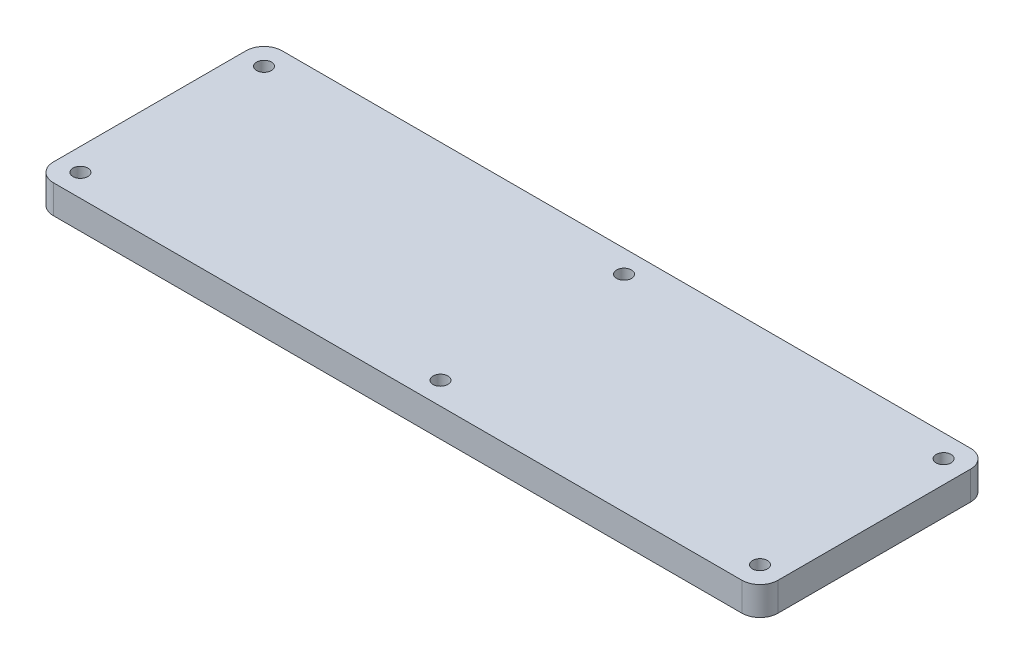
ISO-10303-21;
HEADER;
FILE_DESCRIPTION(('STEP AP214'),'2;1');
FILE_NAME('part.step','',(''),(''),'','','');
FILE_SCHEMA(('AUTOMOTIVE_DESIGN { 1 0 10303 214 1 1 1 1 }'));
ENDSEC;
DATA;
#1=APPLICATION_CONTEXT('core data for automotive mechanical design processes');
#2=APPLICATION_PROTOCOL_DEFINITION('international standard','automotive_design',2000,#1);
#3=PRODUCT_CONTEXT('',#1,'mechanical');
#4=PRODUCT('Part','Part','',(#3));
#5=PRODUCT_RELATED_PRODUCT_CATEGORY('part','',(#4));
#6=PRODUCT_DEFINITION_FORMATION('','',#4);
#7=PRODUCT_DEFINITION_CONTEXT('part definition',#1,'design');
#8=PRODUCT_DEFINITION('design','',#6,#7);
#9=PRODUCT_DEFINITION_SHAPE('','',#8);
#10=(LENGTH_UNIT() NAMED_UNIT(*) SI_UNIT(.MILLI.,.METRE.));
#11=(NAMED_UNIT(*) PLANE_ANGLE_UNIT() SI_UNIT($,.RADIAN.));
#12=(NAMED_UNIT(*) SI_UNIT($,.STERADIAN.) SOLID_ANGLE_UNIT());
#13=UNCERTAINTY_MEASURE_WITH_UNIT(LENGTH_MEASURE(1.E-05),#10,'distance_accuracy_value','');
#14=(GEOMETRIC_REPRESENTATION_CONTEXT(3) GLOBAL_UNCERTAINTY_ASSIGNED_CONTEXT((#13)) GLOBAL_UNIT_ASSIGNED_CONTEXT((#10,
#11,#12)) REPRESENTATION_CONTEXT('',''));
#15=CARTESIAN_POINT('',(0.,0.,0.));
#16=DIRECTION('',(0.,0.,1.));
#17=DIRECTION('',(1.,0.,0.));
#18=AXIS2_PLACEMENT_3D('',#15,#16,#17);
#19=CARTESIAN_POINT('',(-46.4116278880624,6.35,25.1857618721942));
#20=DIRECTION('',(1.,0.,0.));
#21=DIRECTION('',(0.,0.,-1.));
#22=AXIS2_PLACEMENT_3D('',#19,#20,#21);
#23=PLANE('',#22);
#24=DIRECTION('',(0.,0.,1.));
#25=VECTOR('',#24,1.);
#26=CARTESIAN_POINT('',(-46.4116278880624,0.,25.1857618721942));
#27=LINE('',#26,#25);
#28=CARTESIAN_POINT('',(-46.4116278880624,0.,-21.6142381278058));
#29=VERTEX_POINT('',#28);
#30=CARTESIAN_POINT('',(-46.4116278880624,0.,21.1857618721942));
#31=VERTEX_POINT('',#30);
#32=EDGE_CURVE('E133',#29,#31,#27,.T.);
#33=ORIENTED_EDGE('',*,*,#32,.T.);
#34=DIRECTION('',(0.,-1.,0.));
#35=VECTOR('',#34,1.);
#36=CARTESIAN_POINT('',(-46.4116278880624,6.35,21.1857618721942));
#37=LINE('',#36,#35);
#38=CARTESIAN_POINT('',(-46.4116278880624,6.35,21.1857618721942));
#39=VERTEX_POINT('',#38);
#40=EDGE_CURVE('E11',#31,#39,#37,.F.);
#41=ORIENTED_EDGE('',*,*,#40,.T.);
#42=DIRECTION('',(0.,0.,1.));
#43=VECTOR('',#42,1.);
#44=CARTESIAN_POINT('',(-46.4116278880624,6.35,25.1857618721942));
#45=LINE('',#44,#43);
#46=CARTESIAN_POINT('',(-46.4116278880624,6.35,-21.6142381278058));
#47=VERTEX_POINT('',#46);
#48=EDGE_CURVE('E131',#47,#39,#45,.T.);
#49=ORIENTED_EDGE('',*,*,#48,.F.);
#50=DIRECTION('',(0.,-1.,0.));
#51=VECTOR('',#50,1.);
#52=CARTESIAN_POINT('',(-46.4116278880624,6.35,-21.6142381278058));
#53=LINE('',#52,#51);
#54=EDGE_CURVE('E45',#47,#29,#53,.T.);
#55=ORIENTED_EDGE('',*,*,#54,.T.);
#56=EDGE_LOOP('',(#33,#41,#49,#55));
#57=FACE_BOUND('',#56,.T.);
#58=ADVANCED_FACE('F37',(#57),#23,.F.);
#59=CARTESIAN_POINT('',(-46.4116278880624,6.35,25.1857618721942));
#60=DIRECTION('',(0.,0.,-1.));
#61=DIRECTION('',(-1.,0.,0.));
#62=AXIS2_PLACEMENT_3D('',#59,#60,#61);
#63=PLANE('',#62);
#64=DIRECTION('',(1.,0.,0.));
#65=VECTOR('',#64,1.);
#66=CARTESIAN_POINT('',(-46.4116278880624,0.,25.1857618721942));
#67=LINE('',#66,#65);
#68=CARTESIAN_POINT('',(-42.4116278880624,0.,25.1857618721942));
#69=VERTEX_POINT('',#68);
#70=CARTESIAN_POINT('',(110.588372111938,0.,25.1857618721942));
#71=VERTEX_POINT('',#70);
#72=EDGE_CURVE('E129',#69,#71,#67,.T.);
#73=ORIENTED_EDGE('',*,*,#72,.T.);
#74=DIRECTION('',(0.,-1.,0.));
#75=VECTOR('',#74,1.);
#76=CARTESIAN_POINT('',(110.588372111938,6.35,25.1857618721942));
#77=LINE('',#76,#75);
#78=CARTESIAN_POINT('',(110.588372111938,6.35,25.1857618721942));
#79=VERTEX_POINT('',#78);
#80=EDGE_CURVE('E108',#71,#79,#77,.F.);
#81=ORIENTED_EDGE('',*,*,#80,.T.);
#82=DIRECTION('',(1.,0.,0.));
#83=VECTOR('',#82,1.);
#84=CARTESIAN_POINT('',(-46.4116278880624,6.35,25.1857618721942));
#85=LINE('',#84,#83);
#86=CARTESIAN_POINT('',(-42.4116278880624,6.35,25.1857618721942));
#87=VERTEX_POINT('',#86);
#88=EDGE_CURVE('E173',#87,#79,#85,.T.);
#89=ORIENTED_EDGE('',*,*,#88,.F.);
#90=DIRECTION('',(0.,-1.,0.));
#91=VECTOR('',#90,1.);
#92=CARTESIAN_POINT('',(-42.4116278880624,6.35,25.1857618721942));
#93=LINE('',#92,#91);
#94=EDGE_CURVE('E113',#87,#69,#93,.T.);
#95=ORIENTED_EDGE('',*,*,#94,.T.);
#96=EDGE_LOOP('',(#73,#81,#89,#95));
#97=FACE_BOUND('',#96,.T.);
#98=ADVANCED_FACE('F230',(#97),#63,.F.);
#99=CARTESIAN_POINT('',(114.588372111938,6.35,25.1857618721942));
#100=DIRECTION('',(-1.,0.,0.));
#101=DIRECTION('',(0.,0.,1.));
#102=AXIS2_PLACEMENT_3D('',#99,#100,#101);
#103=PLANE('',#102);
#104=DIRECTION('',(0.,0.,-1.));
#105=VECTOR('',#104,1.);
#106=CARTESIAN_POINT('',(114.588372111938,6.35,25.1857618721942));
#107=LINE('',#106,#105);
#108=CARTESIAN_POINT('',(114.588372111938,6.35,21.1857618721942));
#109=VERTEX_POINT('',#108);
#110=CARTESIAN_POINT('',(114.588372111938,6.35,-21.6142381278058));
#111=VERTEX_POINT('',#110);
#112=EDGE_CURVE('E122',#109,#111,#107,.T.);
#113=ORIENTED_EDGE('',*,*,#112,.F.);
#114=DIRECTION('',(0.,-1.,0.));
#115=VECTOR('',#114,1.);
#116=CARTESIAN_POINT('',(114.588372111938,6.35,21.1857618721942));
#117=LINE('',#116,#115);
#118=CARTESIAN_POINT('',(114.588372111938,0.,21.1857618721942));
#119=VERTEX_POINT('',#118);
#120=EDGE_CURVE('E107',#109,#119,#117,.T.);
#121=ORIENTED_EDGE('',*,*,#120,.T.);
#122=DIRECTION('',(0.,0.,-1.));
#123=VECTOR('',#122,1.);
#124=CARTESIAN_POINT('',(114.588372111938,0.,25.1857618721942));
#125=LINE('',#124,#123);
#126=CARTESIAN_POINT('',(114.588372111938,0.,-21.6142381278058));
#127=VERTEX_POINT('',#126);
#128=EDGE_CURVE('E120',#119,#127,#125,.T.);
#129=ORIENTED_EDGE('',*,*,#128,.T.);
#130=DIRECTION('',(0.,-1.,0.));
#131=VECTOR('',#130,1.);
#132=CARTESIAN_POINT('',(114.588372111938,6.35,-21.6142381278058));
#133=LINE('',#132,#131);
#134=EDGE_CURVE('E124',#127,#111,#133,.F.);
#135=ORIENTED_EDGE('',*,*,#134,.T.);
#136=EDGE_LOOP('',(#113,#121,#129,#135));
#137=FACE_BOUND('',#136,.T.);
#138=ADVANCED_FACE('F119',(#137),#103,.F.);
#139=CARTESIAN_POINT('',(-46.4116278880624,6.35,-25.6142381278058));
#140=DIRECTION('',(0.,0.,1.));
#141=DIRECTION('',(1.,0.,0.));
#142=AXIS2_PLACEMENT_3D('',#139,#140,#141);
#143=PLANE('',#142);
#144=DIRECTION('',(-1.,0.,0.));
#145=VECTOR('',#144,1.);
#146=CARTESIAN_POINT('',(-46.4116278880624,6.35,-25.6142381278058));
#147=LINE('',#146,#145);
#148=CARTESIAN_POINT('',(110.588372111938,6.35,-25.6142381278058));
#149=VERTEX_POINT('',#148);
#150=CARTESIAN_POINT('',(-42.4116278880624,6.35,-25.6142381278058));
#151=VERTEX_POINT('',#150);
#152=EDGE_CURVE('E137',#149,#151,#147,.T.);
#153=ORIENTED_EDGE('',*,*,#152,.F.);
#154=DIRECTION('',(0.,-1.,0.));
#155=VECTOR('',#154,1.);
#156=CARTESIAN_POINT('',(110.588372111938,6.35,-25.6142381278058));
#157=LINE('',#156,#155);
#158=CARTESIAN_POINT('',(110.588372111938,0.,-25.6142381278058));
#159=VERTEX_POINT('',#158);
#160=EDGE_CURVE('E154',#149,#159,#157,.T.);
#161=ORIENTED_EDGE('',*,*,#160,.T.);
#162=DIRECTION('',(-1.,0.,0.));
#163=VECTOR('',#162,1.);
#164=CARTESIAN_POINT('',(-46.4116278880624,0.,-25.6142381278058));
#165=LINE('',#164,#163);
#166=CARTESIAN_POINT('',(-42.4116278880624,0.,-25.6142381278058));
#167=VERTEX_POINT('',#166);
#168=EDGE_CURVE('E128',#159,#167,#165,.T.);
#169=ORIENTED_EDGE('',*,*,#168,.T.);
#170=DIRECTION('',(0.,-1.,0.));
#171=VECTOR('',#170,1.);
#172=CARTESIAN_POINT('',(-42.4116278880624,6.35,-25.6142381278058));
#173=LINE('',#172,#171);
#174=EDGE_CURVE('E52',#167,#151,#173,.F.);
#175=ORIENTED_EDGE('',*,*,#174,.T.);
#176=EDGE_LOOP('',(#153,#161,#169,#175));
#177=FACE_BOUND('',#176,.T.);
#178=ADVANCED_FACE('F215',(#177),#143,.F.);
#179=CARTESIAN_POINT('',(0.,6.35,0.));
#180=DIRECTION('',(0.,-1.,0.));
#181=DIRECTION('',(0.,0.,-1.));
#182=AXIS2_PLACEMENT_3D('',#179,#180,#181);
#183=PLANE('',#182);
#184=CARTESIAN_POINT('',(-41.4116278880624,6.35,20.1857618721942));
#185=DIRECTION('',(0.,1.,0.));
#186=DIRECTION('',(0.,0.,1.));
#187=AXIS2_PLACEMENT_3D('',#184,#185,#186);
#188=CIRCLE('',#187,1.65);
#189=CARTESIAN_POINT('',(-41.4116278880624,6.35,21.8357618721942));
#190=VERTEX_POINT('',#189);
#191=EDGE_CURVE('E206',#190,#190,#188,.T.);
#192=ORIENTED_EDGE('',*,*,#191,.F.);
#193=EDGE_LOOP('',(#192));
#194=FACE_BOUND('',#193,.T.);
#195=CARTESIAN_POINT('',(38.5883721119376,6.35,20.1857618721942));
#196=DIRECTION('',(0.,1.,0.));
#197=DIRECTION('',(0.,0.,1.));
#198=AXIS2_PLACEMENT_3D('',#195,#196,#197);
#199=CIRCLE('',#198,1.65);
#200=CARTESIAN_POINT('',(38.5883721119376,6.35,21.8357618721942));
#201=VERTEX_POINT('',#200);
#202=EDGE_CURVE('E200',#201,#201,#199,.T.);
#203=ORIENTED_EDGE('',*,*,#202,.F.);
#204=EDGE_LOOP('',(#203));
#205=FACE_BOUND('',#204,.T.);
#206=CARTESIAN_POINT('',(109.588372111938,6.35,20.1857618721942));
#207=DIRECTION('',(0.,1.,0.));
#208=DIRECTION('',(0.,0.,1.));
#209=AXIS2_PLACEMENT_3D('',#206,#207,#208);
#210=CIRCLE('',#209,1.65);
#211=CARTESIAN_POINT('',(109.588372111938,6.35,21.8357618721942));
#212=VERTEX_POINT('',#211);
#213=EDGE_CURVE('E194',#212,#212,#210,.T.);
#214=ORIENTED_EDGE('',*,*,#213,.F.);
#215=EDGE_LOOP('',(#214));
#216=FACE_BOUND('',#215,.T.);
#217=CARTESIAN_POINT('',(109.588372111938,6.35,-20.6142381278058));
#218=DIRECTION('',(0.,1.,0.));
#219=DIRECTION('',(0.,0.,1.));
#220=AXIS2_PLACEMENT_3D('',#217,#218,#219);
#221=CIRCLE('',#220,1.65);
#222=CARTESIAN_POINT('',(109.588372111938,6.35,-18.9642381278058));
#223=VERTEX_POINT('',#222);
#224=EDGE_CURVE('E188',#223,#223,#221,.T.);
#225=ORIENTED_EDGE('',*,*,#224,.F.);
#226=EDGE_LOOP('',(#225));
#227=FACE_BOUND('',#226,.T.);
#228=CARTESIAN_POINT('',(38.5883721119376,6.35,-20.6142381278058));
#229=DIRECTION('',(0.,1.,0.));
#230=DIRECTION('',(0.,0.,1.));
#231=AXIS2_PLACEMENT_3D('',#228,#229,#230);
#232=CIRCLE('',#231,1.65);
#233=CARTESIAN_POINT('',(38.5883721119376,6.35,-18.9642381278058));
#234=VERTEX_POINT('',#233);
#235=EDGE_CURVE('E182',#234,#234,#232,.T.);
#236=ORIENTED_EDGE('',*,*,#235,.F.);
#237=EDGE_LOOP('',(#236));
#238=FACE_BOUND('',#237,.T.);
#239=CARTESIAN_POINT('',(-41.4116278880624,6.35,-20.6142381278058));
#240=DIRECTION('',(0.,1.,0.));
#241=DIRECTION('',(0.,0.,1.));
#242=AXIS2_PLACEMENT_3D('',#239,#240,#241);
#243=CIRCLE('',#242,1.65);
#244=CARTESIAN_POINT('',(-41.4116278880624,6.35,-18.9642381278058));
#245=VERTEX_POINT('',#244);
#246=EDGE_CURVE('E168',#245,#245,#243,.T.);
#247=ORIENTED_EDGE('',*,*,#246,.F.);
#248=EDGE_LOOP('',(#247));
#249=FACE_BOUND('',#248,.T.);
#250=ORIENTED_EDGE('',*,*,#88,.T.);
#251=CARTESIAN_POINT('',(110.588372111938,6.35,21.1857618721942));
#252=DIRECTION('',(0.,-1.,0.));
#253=DIRECTION('',(0.,0.,-1.));
#254=AXIS2_PLACEMENT_3D('',#251,#252,#253);
#255=CIRCLE('',#254,4.);
#256=EDGE_CURVE('E151',#79,#109,#255,.F.);
#257=ORIENTED_EDGE('',*,*,#256,.T.);
#258=ORIENTED_EDGE('',*,*,#112,.T.);
#259=CARTESIAN_POINT('',(110.588372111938,6.35,-21.6142381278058));
#260=DIRECTION('',(0.,-1.,0.));
#261=DIRECTION('',(0.,0.,-1.));
#262=AXIS2_PLACEMENT_3D('',#259,#260,#261);
#263=CIRCLE('',#262,4.);
#264=EDGE_CURVE('E59',#111,#149,#263,.F.);
#265=ORIENTED_EDGE('',*,*,#264,.T.);
#266=ORIENTED_EDGE('',*,*,#152,.T.);
#267=CARTESIAN_POINT('',(-42.4116278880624,6.35,-21.6142381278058));
#268=DIRECTION('',(0.,-1.,0.));
#269=DIRECTION('',(0.,0.,-1.));
#270=AXIS2_PLACEMENT_3D('',#267,#268,#269);
#271=CIRCLE('',#270,4.);
#272=EDGE_CURVE('E146',#151,#47,#271,.F.);
#273=ORIENTED_EDGE('',*,*,#272,.T.);
#274=ORIENTED_EDGE('',*,*,#48,.T.);
#275=CARTESIAN_POINT('',(-42.4116278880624,6.35,21.1857618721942));
#276=DIRECTION('',(0.,-1.,0.));
#277=DIRECTION('',(0.,0.,-1.));
#278=AXIS2_PLACEMENT_3D('',#275,#276,#277);
#279=CIRCLE('',#278,4.);
#280=EDGE_CURVE('E148',#39,#87,#279,.F.);
#281=ORIENTED_EDGE('',*,*,#280,.T.);
#282=EDGE_LOOP('',(#250,#257,#258,#265,#266,#273,#274,#281));
#283=FACE_BOUND('',#282,.T.);
#284=ADVANCED_FACE('F212',(#194,#205,#216,#227,#238,#249,#283),#183,.F.);
#285=CARTESIAN_POINT('',(0.,0.,0.));
#286=DIRECTION('',(0.,-1.,0.));
#287=DIRECTION('',(0.,0.,-1.));
#288=AXIS2_PLACEMENT_3D('',#285,#286,#287);
#289=PLANE('',#288);
#290=CARTESIAN_POINT('',(-41.4116278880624,0.,20.1857618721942));
#291=DIRECTION('',(0.,1.,0.));
#292=DIRECTION('',(0.,0.,1.));
#293=AXIS2_PLACEMENT_3D('',#290,#291,#292);
#294=CIRCLE('',#293,1.65);
#295=CARTESIAN_POINT('',(-41.4116278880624,0.,21.8357618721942));
#296=VERTEX_POINT('',#295);
#297=EDGE_CURVE('E203',#296,#296,#294,.T.);
#298=ORIENTED_EDGE('',*,*,#297,.T.);
#299=EDGE_LOOP('',(#298));
#300=FACE_BOUND('',#299,.T.);
#301=CARTESIAN_POINT('',(38.5883721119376,0.,20.1857618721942));
#302=DIRECTION('',(0.,1.,0.));
#303=DIRECTION('',(0.,0.,1.));
#304=AXIS2_PLACEMENT_3D('',#301,#302,#303);
#305=CIRCLE('',#304,1.65);
#306=CARTESIAN_POINT('',(38.5883721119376,0.,21.8357618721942));
#307=VERTEX_POINT('',#306);
#308=EDGE_CURVE('E197',#307,#307,#305,.T.);
#309=ORIENTED_EDGE('',*,*,#308,.T.);
#310=EDGE_LOOP('',(#309));
#311=FACE_BOUND('',#310,.T.);
#312=CARTESIAN_POINT('',(109.588372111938,0.,20.1857618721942));
#313=DIRECTION('',(0.,1.,0.));
#314=DIRECTION('',(0.,0.,1.));
#315=AXIS2_PLACEMENT_3D('',#312,#313,#314);
#316=CIRCLE('',#315,1.65);
#317=CARTESIAN_POINT('',(109.588372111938,0.,21.8357618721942));
#318=VERTEX_POINT('',#317);
#319=EDGE_CURVE('E191',#318,#318,#316,.T.);
#320=ORIENTED_EDGE('',*,*,#319,.T.);
#321=EDGE_LOOP('',(#320));
#322=FACE_BOUND('',#321,.T.);
#323=CARTESIAN_POINT('',(109.588372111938,0.,-20.6142381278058));
#324=DIRECTION('',(0.,1.,0.));
#325=DIRECTION('',(0.,0.,1.));
#326=AXIS2_PLACEMENT_3D('',#323,#324,#325);
#327=CIRCLE('',#326,1.65);
#328=CARTESIAN_POINT('',(109.588372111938,0.,-18.9642381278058));
#329=VERTEX_POINT('',#328);
#330=EDGE_CURVE('E185',#329,#329,#327,.T.);
#331=ORIENTED_EDGE('',*,*,#330,.T.);
#332=EDGE_LOOP('',(#331));
#333=FACE_BOUND('',#332,.T.);
#334=CARTESIAN_POINT('',(38.5883721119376,0.,-20.6142381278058));
#335=DIRECTION('',(0.,1.,0.));
#336=DIRECTION('',(0.,0.,1.));
#337=AXIS2_PLACEMENT_3D('',#334,#335,#336);
#338=CIRCLE('',#337,1.65);
#339=CARTESIAN_POINT('',(38.5883721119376,0.,-18.9642381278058));
#340=VERTEX_POINT('',#339);
#341=EDGE_CURVE('E179',#340,#340,#338,.T.);
#342=ORIENTED_EDGE('',*,*,#341,.T.);
#343=EDGE_LOOP('',(#342));
#344=FACE_BOUND('',#343,.T.);
#345=CARTESIAN_POINT('',(-41.4116278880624,0.,-20.6142381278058));
#346=DIRECTION('',(0.,1.,0.));
#347=DIRECTION('',(0.,0.,1.));
#348=AXIS2_PLACEMENT_3D('',#345,#346,#347);
#349=CIRCLE('',#348,1.65);
#350=CARTESIAN_POINT('',(-41.4116278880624,0.,-18.9642381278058));
#351=VERTEX_POINT('',#350);
#352=EDGE_CURVE('E166',#351,#351,#349,.T.);
#353=ORIENTED_EDGE('',*,*,#352,.T.);
#354=EDGE_LOOP('',(#353));
#355=FACE_BOUND('',#354,.T.);
#356=ORIENTED_EDGE('',*,*,#128,.F.);
#357=CARTESIAN_POINT('',(110.588372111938,0.,21.1857618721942));
#358=DIRECTION('',(0.,-1.,0.));
#359=DIRECTION('',(0.,0.,-1.));
#360=AXIS2_PLACEMENT_3D('',#357,#358,#359);
#361=CIRCLE('',#360,4.);
#362=EDGE_CURVE('E103',#119,#71,#361,.T.);
#363=ORIENTED_EDGE('',*,*,#362,.T.);
#364=ORIENTED_EDGE('',*,*,#72,.F.);
#365=CARTESIAN_POINT('',(-42.4116278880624,0.,21.1857618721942));
#366=DIRECTION('',(0.,-1.,0.));
#367=DIRECTION('',(0.,0.,-1.));
#368=AXIS2_PLACEMENT_3D('',#365,#366,#367);
#369=CIRCLE('',#368,4.);
#370=EDGE_CURVE('E140',#69,#31,#369,.T.);
#371=ORIENTED_EDGE('',*,*,#370,.T.);
#372=ORIENTED_EDGE('',*,*,#32,.F.);
#373=CARTESIAN_POINT('',(-42.4116278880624,0.,-21.6142381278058));
#374=DIRECTION('',(0.,-1.,0.));
#375=DIRECTION('',(0.,0.,-1.));
#376=AXIS2_PLACEMENT_3D('',#373,#374,#375);
#377=CIRCLE('',#376,4.);
#378=EDGE_CURVE('E123',#29,#167,#377,.T.);
#379=ORIENTED_EDGE('',*,*,#378,.T.);
#380=ORIENTED_EDGE('',*,*,#168,.F.);
#381=CARTESIAN_POINT('',(110.588372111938,0.,-21.6142381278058));
#382=DIRECTION('',(0.,-1.,0.));
#383=DIRECTION('',(0.,0.,-1.));
#384=AXIS2_PLACEMENT_3D('',#381,#382,#383);
#385=CIRCLE('',#384,4.);
#386=EDGE_CURVE('E114',#159,#127,#385,.T.);
#387=ORIENTED_EDGE('',*,*,#386,.T.);
#388=EDGE_LOOP('',(#356,#363,#364,#371,#372,#379,#380,#387));
#389=FACE_BOUND('',#388,.T.);
#390=ADVANCED_FACE('F126',(#300,#311,#322,#333,#344,#355,#389),#289,.T.);
#391=CARTESIAN_POINT('',(110.588372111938,6.35,21.1857618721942));
#392=DIRECTION('',(0.,-1.,0.));
#393=DIRECTION('',(0.,0.,-1.));
#394=AXIS2_PLACEMENT_3D('',#391,#392,#393);
#395=CYLINDRICAL_SURFACE('',#394,4.);
#396=ORIENTED_EDGE('',*,*,#256,.F.);
#397=ORIENTED_EDGE('',*,*,#80,.F.);
#398=ORIENTED_EDGE('',*,*,#362,.F.);
#399=ORIENTED_EDGE('',*,*,#120,.F.);
#400=EDGE_LOOP('',(#396,#397,#398,#399));
#401=FACE_BOUND('',#400,.T.);
#402=ADVANCED_FACE('F106',(#401),#395,.T.);
#403=CARTESIAN_POINT('',(110.588372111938,6.35,-21.6142381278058));
#404=DIRECTION('',(0.,-1.,0.));
#405=DIRECTION('',(0.,0.,-1.));
#406=AXIS2_PLACEMENT_3D('',#403,#404,#405);
#407=CYLINDRICAL_SURFACE('',#406,4.);
#408=ORIENTED_EDGE('',*,*,#264,.F.);
#409=ORIENTED_EDGE('',*,*,#134,.F.);
#410=ORIENTED_EDGE('',*,*,#386,.F.);
#411=ORIENTED_EDGE('',*,*,#160,.F.);
#412=EDGE_LOOP('',(#408,#409,#410,#411));
#413=FACE_BOUND('',#412,.T.);
#414=ADVANCED_FACE('F242',(#413),#407,.T.);
#415=CARTESIAN_POINT('',(-42.4116278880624,6.35,21.1857618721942));
#416=DIRECTION('',(0.,-1.,0.));
#417=DIRECTION('',(0.,0.,-1.));
#418=AXIS2_PLACEMENT_3D('',#415,#416,#417);
#419=CYLINDRICAL_SURFACE('',#418,4.);
#420=ORIENTED_EDGE('',*,*,#280,.F.);
#421=ORIENTED_EDGE('',*,*,#40,.F.);
#422=ORIENTED_EDGE('',*,*,#370,.F.);
#423=ORIENTED_EDGE('',*,*,#94,.F.);
#424=EDGE_LOOP('',(#420,#421,#422,#423));
#425=FACE_BOUND('',#424,.T.);
#426=ADVANCED_FACE('F232',(#425),#419,.T.);
#427=CARTESIAN_POINT('',(-42.4116278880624,6.35,-21.6142381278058));
#428=DIRECTION('',(0.,-1.,0.));
#429=DIRECTION('',(0.,0.,-1.));
#430=AXIS2_PLACEMENT_3D('',#427,#428,#429);
#431=CYLINDRICAL_SURFACE('',#430,4.);
#432=ORIENTED_EDGE('',*,*,#272,.F.);
#433=ORIENTED_EDGE('',*,*,#174,.F.);
#434=ORIENTED_EDGE('',*,*,#378,.F.);
#435=ORIENTED_EDGE('',*,*,#54,.F.);
#436=EDGE_LOOP('',(#432,#433,#434,#435));
#437=FACE_BOUND('',#436,.T.);
#438=ADVANCED_FACE('F39',(#437),#431,.T.);
#439=CARTESIAN_POINT('',(-41.4116278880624,6.35,-20.6142381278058));
#440=DIRECTION('',(0.,1.,0.));
#441=DIRECTION('',(0.,0.,1.));
#442=AXIS2_PLACEMENT_3D('',#439,#440,#441);
#443=CYLINDRICAL_SURFACE('',#442,1.65);
#444=ORIENTED_EDGE('',*,*,#352,.F.);
#445=EDGE_LOOP('',(#444));
#446=FACE_BOUND('',#445,.T.);
#447=ORIENTED_EDGE('',*,*,#246,.T.);
#448=EDGE_LOOP('',(#447));
#449=FACE_BOUND('',#448,.T.);
#450=ADVANCED_FACE('F234',(#446,#449),#443,.F.);
#451=CARTESIAN_POINT('',(38.5883721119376,6.35,-20.6142381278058));
#452=DIRECTION('',(0.,1.,0.));
#453=DIRECTION('',(0.,0.,1.));
#454=AXIS2_PLACEMENT_3D('',#451,#452,#453);
#455=CYLINDRICAL_SURFACE('',#454,1.65);
#456=ORIENTED_EDGE('',*,*,#341,.F.);
#457=EDGE_LOOP('',(#456));
#458=FACE_BOUND('',#457,.T.);
#459=ORIENTED_EDGE('',*,*,#235,.T.);
#460=EDGE_LOOP('',(#459));
#461=FACE_BOUND('',#460,.T.);
#462=ADVANCED_FACE('F239',(#458,#461),#455,.F.);
#463=CARTESIAN_POINT('',(109.588372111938,6.35,-20.6142381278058));
#464=DIRECTION('',(0.,1.,0.));
#465=DIRECTION('',(0.,0.,1.));
#466=AXIS2_PLACEMENT_3D('',#463,#464,#465);
#467=CYLINDRICAL_SURFACE('',#466,1.65);
#468=ORIENTED_EDGE('',*,*,#330,.F.);
#469=EDGE_LOOP('',(#468));
#470=FACE_BOUND('',#469,.T.);
#471=ORIENTED_EDGE('',*,*,#224,.T.);
#472=EDGE_LOOP('',(#471));
#473=FACE_BOUND('',#472,.T.);
#474=ADVANCED_FACE('F269',(#470,#473),#467,.F.);
#475=CARTESIAN_POINT('',(109.588372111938,6.35,20.1857618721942));
#476=DIRECTION('',(0.,1.,0.));
#477=DIRECTION('',(0.,0.,1.));
#478=AXIS2_PLACEMENT_3D('',#475,#476,#477);
#479=CYLINDRICAL_SURFACE('',#478,1.65);
#480=ORIENTED_EDGE('',*,*,#319,.F.);
#481=EDGE_LOOP('',(#480));
#482=FACE_BOUND('',#481,.T.);
#483=ORIENTED_EDGE('',*,*,#213,.T.);
#484=EDGE_LOOP('',(#483));
#485=FACE_BOUND('',#484,.T.);
#486=ADVANCED_FACE('F273',(#482,#485),#479,.F.);
#487=CARTESIAN_POINT('',(38.5883721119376,6.35,20.1857618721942));
#488=DIRECTION('',(0.,1.,0.));
#489=DIRECTION('',(0.,0.,1.));
#490=AXIS2_PLACEMENT_3D('',#487,#488,#489);
#491=CYLINDRICAL_SURFACE('',#490,1.65);
#492=ORIENTED_EDGE('',*,*,#308,.F.);
#493=EDGE_LOOP('',(#492));
#494=FACE_BOUND('',#493,.T.);
#495=ORIENTED_EDGE('',*,*,#202,.T.);
#496=EDGE_LOOP('',(#495));
#497=FACE_BOUND('',#496,.T.);
#498=ADVANCED_FACE('F277',(#494,#497),#491,.F.);
#499=CARTESIAN_POINT('',(-41.4116278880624,6.35,20.1857618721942));
#500=DIRECTION('',(0.,1.,0.));
#501=DIRECTION('',(0.,0.,1.));
#502=AXIS2_PLACEMENT_3D('',#499,#500,#501);
#503=CYLINDRICAL_SURFACE('',#502,1.65);
#504=ORIENTED_EDGE('',*,*,#297,.F.);
#505=EDGE_LOOP('',(#504));
#506=FACE_BOUND('',#505,.T.);
#507=ORIENTED_EDGE('',*,*,#191,.T.);
#508=EDGE_LOOP('',(#507));
#509=FACE_BOUND('',#508,.T.);
#510=ADVANCED_FACE('F210',(#506,#509),#503,.F.);
#511=CLOSED_SHELL('',(#58,#98,#138,#178,#284,#390,#402,#414,#426,#438,#450,#462,#474,#486,#498,#510));
#512=MANIFOLD_SOLID_BREP('B2',#511);
#513=ADVANCED_BREP_SHAPE_REPRESENTATION('',(#18,#512),#14);
#514=SHAPE_DEFINITION_REPRESENTATION(#9,#513);
ENDSEC;
END-ISO-10303-21;
